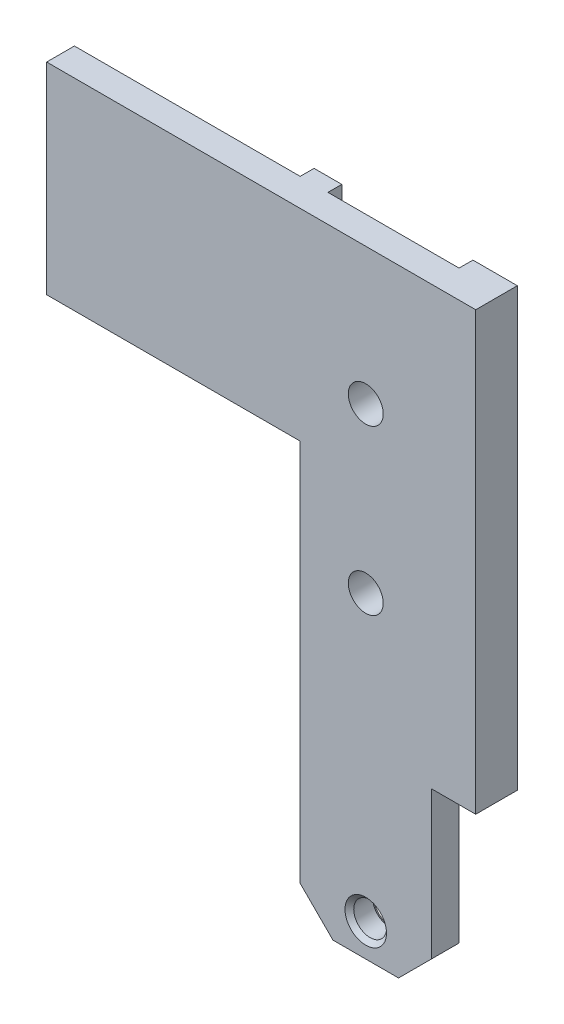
ISO-10303-21;
HEADER;
FILE_DESCRIPTION(('STEP AP214'),'2;1');
FILE_NAME('part.step','',(''),(''),'','','');
FILE_SCHEMA(('AUTOMOTIVE_DESIGN { 1 0 10303 214 1 1 1 1 }'));
ENDSEC;
DATA;
#1=APPLICATION_CONTEXT('core data for automotive mechanical design processes');
#2=APPLICATION_PROTOCOL_DEFINITION('international standard','automotive_design',2000,#1);
#3=PRODUCT_CONTEXT('',#1,'mechanical');
#4=PRODUCT('Part','Part','',(#3));
#5=PRODUCT_RELATED_PRODUCT_CATEGORY('part','',(#4));
#6=PRODUCT_DEFINITION_FORMATION('','',#4);
#7=PRODUCT_DEFINITION_CONTEXT('part definition',#1,'design');
#8=PRODUCT_DEFINITION('design','',#6,#7);
#9=PRODUCT_DEFINITION_SHAPE('','',#8);
#10=(LENGTH_UNIT() NAMED_UNIT(*) SI_UNIT(.MILLI.,.METRE.));
#11=(NAMED_UNIT(*) PLANE_ANGLE_UNIT() SI_UNIT($,.RADIAN.));
#12=(NAMED_UNIT(*) SI_UNIT($,.STERADIAN.) SOLID_ANGLE_UNIT());
#13=UNCERTAINTY_MEASURE_WITH_UNIT(LENGTH_MEASURE(1.E-05),#10,'distance_accuracy_value','');
#14=(GEOMETRIC_REPRESENTATION_CONTEXT(3) GLOBAL_UNCERTAINTY_ASSIGNED_CONTEXT((#13)) GLOBAL_UNIT_ASSIGNED_CONTEXT((#10,
#11,#12)) REPRESENTATION_CONTEXT('',''));
#15=CARTESIAN_POINT('',(0.,0.,0.));
#16=DIRECTION('',(0.,0.,1.));
#17=DIRECTION('',(1.,0.,0.));
#18=AXIS2_PLACEMENT_3D('',#15,#16,#17);
#19=CARTESIAN_POINT('',(-3.00101,0.,-0.634999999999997));
#20=DIRECTION('',(0.,0.,-1.));
#21=DIRECTION('',(-1.,0.,0.));
#22=AXIS2_PLACEMENT_3D('',#19,#20,#21);
#23=PLANE('',#22);
#24=CARTESIAN_POINT('',(0.,-13.75,-0.635));
#25=DIRECTION('',(0.,0.,-1.));
#26=DIRECTION('',(-1.,0.,0.));
#27=AXIS2_PLACEMENT_3D('',#24,#25,#26);
#28=CIRCLE('',#27,0.799999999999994);
#29=CARTESIAN_POINT('',(-0.799999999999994,-13.75,-0.635));
#30=VERTEX_POINT('',#29);
#31=EDGE_CURVE('E335',#30,#30,#28,.T.);
#32=ORIENTED_EDGE('',*,*,#31,.F.);
#33=EDGE_LOOP('',(#32));
#34=FACE_BOUND('',#33,.T.);
#35=CARTESIAN_POINT('',(0.,-6.25,-0.634999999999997));
#36=DIRECTION('',(0.,0.,-1.));
#37=DIRECTION('',(-1.,0.,0.));
#38=AXIS2_PLACEMENT_3D('',#35,#36,#37);
#39=CIRCLE('',#38,0.799999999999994);
#40=CARTESIAN_POINT('',(-0.799999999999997,-6.25,-0.634999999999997));
#41=VERTEX_POINT('',#40);
#42=EDGE_CURVE('E156',#41,#41,#39,.T.);
#43=ORIENTED_EDGE('',*,*,#42,.F.);
#44=EDGE_LOOP('',(#43));
#45=FACE_BOUND('',#44,.T.);
#46=CARTESIAN_POINT('',(0.,-26.755,-0.634999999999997));
#47=DIRECTION('',(0.,0.,-1.));
#48=DIRECTION('',(-1.,0.,0.));
#49=AXIS2_PLACEMENT_3D('',#46,#47,#48);
#50=CIRCLE('',#49,0.950000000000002);
#51=CARTESIAN_POINT('',(-0.950000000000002,-26.755,-0.634999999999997));
#52=VERTEX_POINT('',#51);
#53=EDGE_CURVE('E217',#52,#52,#50,.F.);
#54=ORIENTED_EDGE('',*,*,#53,.T.);
#55=EDGE_LOOP('',(#54));
#56=FACE_BOUND('',#55,.T.);
#57=DIRECTION('',(1.,0.,0.));
#58=VECTOR('',#57,1.);
#59=CARTESIAN_POINT('',(-3.00101,-28.255,-0.635));
#60=LINE('',#59,#58);
#61=CARTESIAN_POINT('',(-1.50101,-28.255,-0.635));
#62=VERTEX_POINT('',#61);
#63=CARTESIAN_POINT('',(1.50101,-28.255,-0.635000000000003));
#64=VERTEX_POINT('',#63);
#65=EDGE_CURVE('E231',#62,#64,#60,.T.);
#66=ORIENTED_EDGE('',*,*,#65,.F.);
#67=DIRECTION('',(0.707106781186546,-0.707106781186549,0.));
#68=VECTOR('',#67,1.);
#69=CARTESIAN_POINT('',(-16.37851,-13.3774999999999,-0.634999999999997));
#70=LINE('',#69,#68);
#71=CARTESIAN_POINT('',(-3.00101,-26.755,-0.634999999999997));
#72=VERTEX_POINT('',#71);
#73=EDGE_CURVE('E205',#62,#72,#70,.F.);
#74=ORIENTED_EDGE('',*,*,#73,.T.);
#75=DIRECTION('',(0.,-1.,0.));
#76=VECTOR('',#75,1.);
#77=CARTESIAN_POINT('',(-3.00101,-9.2253064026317,-0.635));
#78=LINE('',#77,#76);
#79=CARTESIAN_POINT('',(-3.00101,-9.2253064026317,-0.635));
#80=VERTEX_POINT('',#79);
#81=EDGE_CURVE('E235',#80,#72,#78,.T.);
#82=ORIENTED_EDGE('',*,*,#81,.F.);
#83=DIRECTION('',(0.,-1.,0.));
#84=VECTOR('',#83,1.);
#85=CARTESIAN_POINT('',(-3.00101,-9.2253064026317,-0.635));
#86=LINE('',#85,#84);
#87=CARTESIAN_POINT('',(-3.00101,0.,-0.634999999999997));
#88=VERTEX_POINT('',#87);
#89=EDGE_CURVE('E252',#88,#80,#86,.T.);
#90=ORIENTED_EDGE('',*,*,#89,.F.);
#91=DIRECTION('',(-1.,0.,0.));
#92=VECTOR('',#91,1.);
#93=CARTESIAN_POINT('',(5.03301,0.,-0.635));
#94=LINE('',#93,#92);
#95=CARTESIAN_POINT('',(3.00101,0.,-0.635));
#96=VERTEX_POINT('',#95);
#97=EDGE_CURVE('E225',#96,#88,#94,.T.);
#98=ORIENTED_EDGE('',*,*,#97,.F.);
#99=DIRECTION('',(0.,1.,0.));
#100=VECTOR('',#99,1.);
#101=CARTESIAN_POINT('',(3.00101,0.,-0.635));
#102=LINE('',#101,#100);
#103=CARTESIAN_POINT('',(3.00101,-20.,-0.635000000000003));
#104=VERTEX_POINT('',#103);
#105=EDGE_CURVE('E310',#104,#96,#102,.T.);
#106=ORIENTED_EDGE('',*,*,#105,.F.);
#107=CARTESIAN_POINT('',(3.00101,-26.755,-0.635));
#108=VERTEX_POINT('',#107);
#109=EDGE_CURVE('E308',#108,#104,#102,.T.);
#110=ORIENTED_EDGE('',*,*,#109,.F.);
#111=DIRECTION('',(0.707106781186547,0.707106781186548,0.));
#112=VECTOR('',#111,1.);
#113=CARTESIAN_POINT('',(13.3775,-16.37851,-0.635));
#114=LINE('',#113,#112);
#115=EDGE_CURVE('E207',#108,#64,#114,.F.);
#116=ORIENTED_EDGE('',*,*,#115,.T.);
#117=EDGE_LOOP('',(#66,#74,#82,#90,#98,#106,#110,#116));
#118=FACE_BOUND('',#117,.T.);
#119=ADVANCED_FACE('F30',(#34,#45,#56,#118),#23,.T.);
#120=DIRECTION('',(0.,1.,0.));
#121=VECTOR('',#120,1.);
#122=CARTESIAN_POINT('',(-4.27101,-9.22530640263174,-0.635));
#123=LINE('',#122,#121);
#124=CARTESIAN_POINT('',(-4.27101,-9.22530640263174,-0.635));
#125=VERTEX_POINT('',#124);
#126=CARTESIAN_POINT('',(-4.27101,0.,-0.634999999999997));
#127=VERTEX_POINT('',#126);
#128=EDGE_CURVE('E258',#125,#127,#123,.T.);
#129=ORIENTED_EDGE('',*,*,#128,.F.);
#130=DIRECTION('',(1.,0.,0.));
#131=VECTOR('',#130,1.);
#132=CARTESIAN_POINT('',(-14.605,-9.2253064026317,-0.635000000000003));
#133=LINE('',#132,#131);
#134=CARTESIAN_POINT('',(-14.605,-9.2253064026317,-0.635000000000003));
#135=VERTEX_POINT('',#134);
#136=EDGE_CURVE('E183',#135,#125,#133,.T.);
#137=ORIENTED_EDGE('',*,*,#136,.F.);
#138=DIRECTION('',(0.,-1.,0.));
#139=VECTOR('',#138,1.);
#140=CARTESIAN_POINT('',(-14.605,0.,-0.635));
#141=LINE('',#140,#139);
#142=CARTESIAN_POINT('',(-14.605,0.,-0.635));
#143=VERTEX_POINT('',#142);
#144=EDGE_CURVE('E187',#143,#135,#141,.T.);
#145=ORIENTED_EDGE('',*,*,#144,.F.);
#146=EDGE_CURVE('E188',#127,#143,#94,.T.);
#147=ORIENTED_EDGE('',*,*,#146,.F.);
#148=EDGE_LOOP('',(#129,#137,#145,#147));
#149=FACE_BOUND('',#148,.T.);
#150=ADVANCED_FACE('F277',(#149),#23,.T.);
#151=CARTESIAN_POINT('',(-3.00101,-9.2253064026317,0.635));
#152=DIRECTION('',(1.,0.,0.));
#153=DIRECTION('',(0.,1.,0.));
#154=AXIS2_PLACEMENT_3D('',#151,#152,#153);
#155=PLANE('',#154);
#156=ORIENTED_EDGE('',*,*,#81,.T.);
#157=DIRECTION('',(0.,0.,1.));
#158=VECTOR('',#157,1.);
#159=CARTESIAN_POINT('',(-3.00101,-26.755,0.635000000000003));
#160=LINE('',#159,#158);
#161=CARTESIAN_POINT('',(-3.00101,-26.755,0.635000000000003));
#162=VERTEX_POINT('',#161);
#163=EDGE_CURVE('E53',#72,#162,#160,.T.);
#164=ORIENTED_EDGE('',*,*,#163,.T.);
#165=DIRECTION('',(0.,-1.,0.));
#166=VECTOR('',#165,1.);
#167=CARTESIAN_POINT('',(-3.00101,-9.2253064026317,0.635));
#168=LINE('',#167,#166);
#169=CARTESIAN_POINT('',(-3.00101,-9.2253064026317,0.635));
#170=VERTEX_POINT('',#169);
#171=EDGE_CURVE('E166',#170,#162,#168,.T.);
#172=ORIENTED_EDGE('',*,*,#171,.F.);
#173=DIRECTION('',(0.,0.,-1.));
#174=VECTOR('',#173,1.);
#175=CARTESIAN_POINT('',(-3.00101,-9.2253064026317,0.635));
#176=LINE('',#175,#174);
#177=EDGE_CURVE('E173',#170,#80,#176,.T.);
#178=ORIENTED_EDGE('',*,*,#177,.T.);
#179=EDGE_LOOP('',(#156,#164,#172,#178));
#180=FACE_BOUND('',#179,.T.);
#181=ADVANCED_FACE('F32',(#180),#155,.F.);
#182=CARTESIAN_POINT('',(-3.00101,-28.255,0.635));
#183=DIRECTION('',(0.,1.,0.));
#184=DIRECTION('',(0.,0.,1.));
#185=AXIS2_PLACEMENT_3D('',#182,#183,#184);
#186=PLANE('',#185);
#187=DIRECTION('',(1.,0.,0.));
#188=VECTOR('',#187,1.);
#189=CARTESIAN_POINT('',(-3.00101,-28.255,0.635));
#190=LINE('',#189,#188);
#191=CARTESIAN_POINT('',(-1.50101,-28.255,0.635));
#192=VERTEX_POINT('',#191);
#193=CARTESIAN_POINT('',(1.50101,-28.255,0.634999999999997));
#194=VERTEX_POINT('',#193);
#195=EDGE_CURVE('E162',#192,#194,#190,.T.);
#196=ORIENTED_EDGE('',*,*,#195,.F.);
#197=DIRECTION('',(0.,0.,-1.));
#198=VECTOR('',#197,1.);
#199=CARTESIAN_POINT('',(-1.50101,-28.255,0.635));
#200=LINE('',#199,#198);
#201=EDGE_CURVE('E201',#192,#62,#200,.T.);
#202=ORIENTED_EDGE('',*,*,#201,.T.);
#203=ORIENTED_EDGE('',*,*,#65,.T.);
#204=DIRECTION('',(0.,0.,1.));
#205=VECTOR('',#204,1.);
#206=CARTESIAN_POINT('',(1.50101,-28.255,0.634999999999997));
#207=LINE('',#206,#205);
#208=EDGE_CURVE('E210',#64,#194,#207,.T.);
#209=ORIENTED_EDGE('',*,*,#208,.T.);
#210=EDGE_LOOP('',(#196,#202,#203,#209));
#211=FACE_BOUND('',#210,.T.);
#212=ADVANCED_FACE('F299',(#211),#186,.F.);
#213=CARTESIAN_POINT('',(5.03301,0.,0.635));
#214=DIRECTION('',(-1.,0.,0.));
#215=DIRECTION('',(0.,-1.,0.));
#216=AXIS2_PLACEMENT_3D('',#213,#214,#215);
#217=PLANE('',#216);
#218=DIRECTION('',(0.,1.,0.));
#219=VECTOR('',#218,1.);
#220=CARTESIAN_POINT('',(5.03301,0.,0.635));
#221=LINE('',#220,#219);
#222=CARTESIAN_POINT('',(5.03301,-20.,0.634999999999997));
#223=VERTEX_POINT('',#222);
#224=CARTESIAN_POINT('',(5.03301,0.,0.635));
#225=VERTEX_POINT('',#224);
#226=EDGE_CURVE('E154',#223,#225,#221,.T.);
#227=ORIENTED_EDGE('',*,*,#226,.F.);
#228=DIRECTION('',(0.,0.,1.));
#229=VECTOR('',#228,1.);
#230=CARTESIAN_POINT('',(5.03301,-20.,-1.270025));
#231=LINE('',#230,#229);
#232=CARTESIAN_POINT('',(5.03301,-20.,-1.27));
#233=VERTEX_POINT('',#232);
#234=EDGE_CURVE('E139',#233,#223,#231,.T.);
#235=ORIENTED_EDGE('',*,*,#234,.F.);
#236=DIRECTION('',(0.,-1.,0.));
#237=VECTOR('',#236,1.);
#238=CARTESIAN_POINT('',(5.03301,0.,-1.27));
#239=LINE('',#238,#237);
#240=CARTESIAN_POINT('',(5.03301,0.,-1.27));
#241=VERTEX_POINT('',#240);
#242=EDGE_CURVE('E311',#241,#233,#239,.T.);
#243=ORIENTED_EDGE('',*,*,#242,.F.);
#244=DIRECTION('',(0.,0.,-1.));
#245=VECTOR('',#244,1.);
#246=CARTESIAN_POINT('',(5.03301,0.,0.635));
#247=LINE('',#246,#245);
#248=EDGE_CURVE('E159',#225,#241,#247,.T.);
#249=ORIENTED_EDGE('',*,*,#248,.F.);
#250=EDGE_LOOP('',(#227,#235,#243,#249));
#251=FACE_BOUND('',#250,.T.);
#252=ADVANCED_FACE('F158',(#251),#217,.F.);
#253=CARTESIAN_POINT('',(5.03301,0.,0.635));
#254=DIRECTION('',(0.,-1.,0.));
#255=DIRECTION('',(1.,0.,0.));
#256=AXIS2_PLACEMENT_3D('',#253,#254,#255);
#257=PLANE('',#256);
#258=ORIENTED_EDGE('',*,*,#248,.T.);
#259=DIRECTION('',(1.,0.,0.));
#260=VECTOR('',#259,1.);
#261=CARTESIAN_POINT('',(5.03301,0.,-1.27));
#262=LINE('',#261,#260);
#263=CARTESIAN_POINT('',(3.00101,0.,-1.27));
#264=VERTEX_POINT('',#263);
#265=EDGE_CURVE('E318',#264,#241,#262,.T.);
#266=ORIENTED_EDGE('',*,*,#265,.F.);
#267=DIRECTION('',(0.,0.,1.));
#268=VECTOR('',#267,1.);
#269=CARTESIAN_POINT('',(3.00101,0.,-1.27));
#270=LINE('',#269,#268);
#271=EDGE_CURVE('E255',#264,#96,#270,.T.);
#272=ORIENTED_EDGE('',*,*,#271,.T.);
#273=ORIENTED_EDGE('',*,*,#97,.T.);
#274=DIRECTION('',(0.,0.,1.));
#275=VECTOR('',#274,1.);
#276=CARTESIAN_POINT('',(-3.00101,0.,-1.27));
#277=LINE('',#276,#275);
#278=CARTESIAN_POINT('',(-3.00101,0.,-1.27));
#279=VERTEX_POINT('',#278);
#280=EDGE_CURVE('E241',#279,#88,#277,.T.);
#281=ORIENTED_EDGE('',*,*,#280,.F.);
#282=DIRECTION('',(1.,0.,0.));
#283=VECTOR('',#282,1.);
#284=CARTESIAN_POINT('',(-4.27101,0.,-1.27));
#285=LINE('',#284,#283);
#286=CARTESIAN_POINT('',(-4.27101,0.,-1.27));
#287=VERTEX_POINT('',#286);
#288=EDGE_CURVE('E247',#287,#279,#285,.T.);
#289=ORIENTED_EDGE('',*,*,#288,.F.);
#290=DIRECTION('',(0.,0.,1.));
#291=VECTOR('',#290,1.);
#292=CARTESIAN_POINT('',(-4.27101,0.,-1.27));
#293=LINE('',#292,#291);
#294=EDGE_CURVE('E237',#287,#127,#293,.T.);
#295=ORIENTED_EDGE('',*,*,#294,.T.);
#296=ORIENTED_EDGE('',*,*,#146,.T.);
#297=DIRECTION('',(0.,0.,-1.));
#298=VECTOR('',#297,1.);
#299=CARTESIAN_POINT('',(-14.605,0.,0.635));
#300=LINE('',#299,#298);
#301=CARTESIAN_POINT('',(-14.605,0.,0.635));
#302=VERTEX_POINT('',#301);
#303=EDGE_CURVE('E178',#302,#143,#300,.T.);
#304=ORIENTED_EDGE('',*,*,#303,.F.);
#305=DIRECTION('',(-1.,0.,0.));
#306=VECTOR('',#305,1.);
#307=CARTESIAN_POINT('',(5.03301,0.,0.635));
#308=LINE('',#307,#306);
#309=EDGE_CURVE('E161',#225,#302,#308,.T.);
#310=ORIENTED_EDGE('',*,*,#309,.F.);
#311=EDGE_LOOP('',(#258,#266,#272,#273,#281,#289,#295,#296,#304,#310));
#312=FACE_BOUND('',#311,.T.);
#313=ADVANCED_FACE('F281',(#312),#257,.F.);
#314=CARTESIAN_POINT('',(-14.605,0.,0.635));
#315=DIRECTION('',(1.,0.,0.));
#316=DIRECTION('',(0.,1.,0.));
#317=AXIS2_PLACEMENT_3D('',#314,#315,#316);
#318=PLANE('',#317);
#319=ORIENTED_EDGE('',*,*,#303,.T.);
#320=ORIENTED_EDGE('',*,*,#144,.T.);
#321=DIRECTION('',(0.,0.,-1.));
#322=VECTOR('',#321,1.);
#323=CARTESIAN_POINT('',(-14.605,-9.2253064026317,0.634999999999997));
#324=LINE('',#323,#322);
#325=CARTESIAN_POINT('',(-14.605,-9.2253064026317,0.634999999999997));
#326=VERTEX_POINT('',#325);
#327=EDGE_CURVE('E176',#326,#135,#324,.T.);
#328=ORIENTED_EDGE('',*,*,#327,.F.);
#329=DIRECTION('',(0.,-1.,0.));
#330=VECTOR('',#329,1.);
#331=CARTESIAN_POINT('',(-14.605,0.,0.635));
#332=LINE('',#331,#330);
#333=EDGE_CURVE('E164',#302,#326,#332,.T.);
#334=ORIENTED_EDGE('',*,*,#333,.F.);
#335=EDGE_LOOP('',(#319,#320,#328,#334));
#336=FACE_BOUND('',#335,.T.);
#337=ADVANCED_FACE('F383',(#336),#318,.F.);
#338=CARTESIAN_POINT('',(-14.605,-9.2253064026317,0.634999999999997));
#339=DIRECTION('',(0.,1.,0.));
#340=DIRECTION('',(0.,0.,1.));
#341=AXIS2_PLACEMENT_3D('',#338,#339,#340);
#342=PLANE('',#341);
#343=ORIENTED_EDGE('',*,*,#327,.T.);
#344=ORIENTED_EDGE('',*,*,#136,.T.);
#345=DIRECTION('',(0.,0.,1.));
#346=VECTOR('',#345,1.);
#347=CARTESIAN_POINT('',(-4.27101,-9.22530640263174,-1.27));
#348=LINE('',#347,#346);
#349=CARTESIAN_POINT('',(-4.27101,-9.22530640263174,-1.27));
#350=VERTEX_POINT('',#349);
#351=EDGE_CURVE('E242',#350,#125,#348,.T.);
#352=ORIENTED_EDGE('',*,*,#351,.F.);
#353=DIRECTION('',(-1.,0.,0.));
#354=VECTOR('',#353,1.);
#355=CARTESIAN_POINT('',(-4.27101,-9.22530640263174,-1.27));
#356=LINE('',#355,#354);
#357=CARTESIAN_POINT('',(-3.00101,-9.2253064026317,-1.27));
#358=VERTEX_POINT('',#357);
#359=EDGE_CURVE('E243',#358,#350,#356,.T.);
#360=ORIENTED_EDGE('',*,*,#359,.F.);
#361=DIRECTION('',(0.,0.,1.));
#362=VECTOR('',#361,1.);
#363=CARTESIAN_POINT('',(-3.00101,-9.2253064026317,-1.27));
#364=LINE('',#363,#362);
#365=EDGE_CURVE('E238',#358,#80,#364,.T.);
#366=ORIENTED_EDGE('',*,*,#365,.T.);
#367=ORIENTED_EDGE('',*,*,#177,.F.);
#368=DIRECTION('',(1.,0.,0.));
#369=VECTOR('',#368,1.);
#370=CARTESIAN_POINT('',(-14.605,-9.2253064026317,0.634999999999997));
#371=LINE('',#370,#369);
#372=EDGE_CURVE('E171',#326,#170,#371,.T.);
#373=ORIENTED_EDGE('',*,*,#372,.F.);
#374=EDGE_LOOP('',(#343,#344,#352,#360,#366,#367,#373));
#375=FACE_BOUND('',#374,.T.);
#376=ADVANCED_FACE('F271',(#375),#342,.F.);
#377=CARTESIAN_POINT('',(-3.00101,0.,0.635000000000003));
#378=DIRECTION('',(0.,0.,-1.));
#379=DIRECTION('',(-1.,0.,0.));
#380=AXIS2_PLACEMENT_3D('',#377,#378,#379);
#381=PLANE('',#380);
#382=CARTESIAN_POINT('',(0.,-13.75,0.635000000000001));
#383=DIRECTION('',(0.,0.,1.));
#384=DIRECTION('',(1.,0.,0.));
#385=AXIS2_PLACEMENT_3D('',#382,#383,#384);
#386=CIRCLE('',#385,0.799999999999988);
#387=CARTESIAN_POINT('',(0.799999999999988,-13.75,0.635000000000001));
#388=VERTEX_POINT('',#387);
#389=EDGE_CURVE('E338',#388,#388,#386,.T.);
#390=ORIENTED_EDGE('',*,*,#389,.F.);
#391=EDGE_LOOP('',(#390));
#392=FACE_BOUND('',#391,.T.);
#393=CARTESIAN_POINT('',(0.,-6.25,0.635000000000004));
#394=DIRECTION('',(0.,0.,1.));
#395=DIRECTION('',(1.,0.,0.));
#396=AXIS2_PLACEMENT_3D('',#393,#394,#395);
#397=CIRCLE('',#396,0.799999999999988);
#398=CARTESIAN_POINT('',(0.799999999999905,-6.25,0.635000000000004));
#399=VERTEX_POINT('',#398);
#400=EDGE_CURVE('E332',#399,#399,#397,.T.);
#401=ORIENTED_EDGE('',*,*,#400,.F.);
#402=EDGE_LOOP('',(#401));
#403=FACE_BOUND('',#402,.T.);
#404=CARTESIAN_POINT('',(0.,-26.755,0.635000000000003));
#405=DIRECTION('',(0.,0.,-1.));
#406=DIRECTION('',(-1.,0.,0.));
#407=AXIS2_PLACEMENT_3D('',#404,#405,#406);
#408=CIRCLE('',#407,0.950000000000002);
#409=CARTESIAN_POINT('',(-0.950000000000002,-26.755,0.635000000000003));
#410=VERTEX_POINT('',#409);
#411=EDGE_CURVE('E214',#410,#410,#408,.T.);
#412=ORIENTED_EDGE('',*,*,#411,.T.);
#413=EDGE_LOOP('',(#412));
#414=FACE_BOUND('',#413,.T.);
#415=ORIENTED_EDGE('',*,*,#171,.T.);
#416=DIRECTION('',(-0.707106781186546,0.707106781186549,0.));
#417=VECTOR('',#416,1.);
#418=CARTESIAN_POINT('',(-1.50101,-28.255,0.635));
#419=LINE('',#418,#417);
#420=EDGE_CURVE('E38',#162,#192,#419,.F.);
#421=ORIENTED_EDGE('',*,*,#420,.T.);
#422=ORIENTED_EDGE('',*,*,#195,.T.);
#423=DIRECTION('',(-0.707106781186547,-0.707106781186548,0.));
#424=VECTOR('',#423,1.);
#425=CARTESIAN_POINT('',(1.50101,-28.255,0.634999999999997));
#426=LINE('',#425,#424);
#427=CARTESIAN_POINT('',(3.00101,-26.755,0.635));
#428=VERTEX_POINT('',#427);
#429=EDGE_CURVE('E45',#194,#428,#426,.F.);
#430=ORIENTED_EDGE('',*,*,#429,.T.);
#431=DIRECTION('',(0.,-1.,0.));
#432=VECTOR('',#431,1.);
#433=CARTESIAN_POINT('',(3.00101,-28.255,0.635));
#434=LINE('',#433,#432);
#435=CARTESIAN_POINT('',(3.00101,-20.,0.634999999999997));
#436=VERTEX_POINT('',#435);
#437=EDGE_CURVE('E151',#436,#428,#434,.T.);
#438=ORIENTED_EDGE('',*,*,#437,.F.);
#439=DIRECTION('',(-1.,0.,0.));
#440=VECTOR('',#439,1.);
#441=CARTESIAN_POINT('',(5.03301,-20.,0.634999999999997));
#442=LINE('',#441,#440);
#443=EDGE_CURVE('E143',#223,#436,#442,.T.);
#444=ORIENTED_EDGE('',*,*,#443,.F.);
#445=ORIENTED_EDGE('',*,*,#226,.T.);
#446=ORIENTED_EDGE('',*,*,#309,.T.);
#447=ORIENTED_EDGE('',*,*,#333,.T.);
#448=ORIENTED_EDGE('',*,*,#372,.T.);
#449=EDGE_LOOP('',(#415,#421,#422,#430,#438,#444,#445,#446,#447,#448));
#450=FACE_BOUND('',#449,.T.);
#451=ADVANCED_FACE('F153',(#392,#403,#414,#450),#381,.F.);
#452=CARTESIAN_POINT('',(-4.27101,-9.22530640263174,-1.27));
#453=DIRECTION('',(1.,0.,0.));
#454=DIRECTION('',(0.,0.,-1.));
#455=AXIS2_PLACEMENT_3D('',#452,#453,#454);
#456=PLANE('',#455);
#457=ORIENTED_EDGE('',*,*,#128,.T.);
#458=ORIENTED_EDGE('',*,*,#294,.F.);
#459=DIRECTION('',(0.,1.,0.));
#460=VECTOR('',#459,1.);
#461=CARTESIAN_POINT('',(-4.27101,-9.22530640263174,-1.27));
#462=LINE('',#461,#460);
#463=EDGE_CURVE('E249',#350,#287,#462,.T.);
#464=ORIENTED_EDGE('',*,*,#463,.F.);
#465=ORIENTED_EDGE('',*,*,#351,.T.);
#466=EDGE_LOOP('',(#457,#458,#464,#465));
#467=FACE_BOUND('',#466,.T.);
#468=ADVANCED_FACE('F267',(#467),#456,.F.);
#469=CARTESIAN_POINT('',(-3.00101,-9.2253064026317,-1.27));
#470=DIRECTION('',(-1.,0.,0.));
#471=DIRECTION('',(0.,-1.,0.));
#472=AXIS2_PLACEMENT_3D('',#469,#470,#471);
#473=PLANE('',#472);
#474=ORIENTED_EDGE('',*,*,#89,.T.);
#475=ORIENTED_EDGE('',*,*,#365,.F.);
#476=DIRECTION('',(0.,-1.,0.));
#477=VECTOR('',#476,1.);
#478=CARTESIAN_POINT('',(-3.00101,-9.2253064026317,-1.27));
#479=LINE('',#478,#477);
#480=EDGE_CURVE('E245',#279,#358,#479,.T.);
#481=ORIENTED_EDGE('',*,*,#480,.F.);
#482=ORIENTED_EDGE('',*,*,#280,.T.);
#483=EDGE_LOOP('',(#474,#475,#481,#482));
#484=FACE_BOUND('',#483,.T.);
#485=ADVANCED_FACE('F293',(#484),#473,.F.);
#486=CARTESIAN_POINT('',(-4.27101,-9.22530640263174,-1.27));
#487=DIRECTION('',(0.,0.,-1.));
#488=DIRECTION('',(-1.,0.,0.));
#489=AXIS2_PLACEMENT_3D('',#486,#487,#488);
#490=PLANE('',#489);
#491=ORIENTED_EDGE('',*,*,#463,.T.);
#492=ORIENTED_EDGE('',*,*,#288,.T.);
#493=ORIENTED_EDGE('',*,*,#480,.T.);
#494=ORIENTED_EDGE('',*,*,#359,.T.);
#495=EDGE_LOOP('',(#491,#492,#493,#494));
#496=FACE_BOUND('',#495,.T.);
#497=ADVANCED_FACE('F458',(#496),#490,.T.);
#498=CARTESIAN_POINT('',(3.00101,0.,-1.27));
#499=DIRECTION('',(1.,0.,0.));
#500=DIRECTION('',(0.,1.,0.));
#501=AXIS2_PLACEMENT_3D('',#498,#499,#500);
#502=PLANE('',#501);
#503=DIRECTION('',(0.,1.,0.));
#504=VECTOR('',#503,1.);
#505=CARTESIAN_POINT('',(3.00101,0.,-1.27));
#506=LINE('',#505,#504);
#507=CARTESIAN_POINT('',(3.00101,-20.,-1.27));
#508=VERTEX_POINT('',#507);
#509=EDGE_CURVE('E313',#508,#264,#506,.T.);
#510=ORIENTED_EDGE('',*,*,#509,.F.);
#511=DIRECTION('',(0.,0.,1.));
#512=VECTOR('',#511,1.);
#513=CARTESIAN_POINT('',(3.00101,-20.,-1.270025));
#514=LINE('',#513,#512);
#515=EDGE_CURVE('E315',#508,#104,#514,.T.);
#516=ORIENTED_EDGE('',*,*,#515,.T.);
#517=ORIENTED_EDGE('',*,*,#105,.T.);
#518=ORIENTED_EDGE('',*,*,#271,.F.);
#519=EDGE_LOOP('',(#510,#516,#517,#518));
#520=FACE_BOUND('',#519,.T.);
#521=ADVANCED_FACE('F326',(#520),#502,.F.);
#522=CARTESIAN_POINT('',(5.03301,-28.255,-1.27));
#523=DIRECTION('',(0.,0.,-1.));
#524=DIRECTION('',(-1.,0.,0.));
#525=AXIS2_PLACEMENT_3D('',#522,#523,#524);
#526=PLANE('',#525);
#527=DIRECTION('',(1.,0.,0.));
#528=VECTOR('',#527,1.);
#529=CARTESIAN_POINT('',(5.03301,-20.,-1.27));
#530=LINE('',#529,#528);
#531=EDGE_CURVE('E145',#508,#233,#530,.T.);
#532=ORIENTED_EDGE('',*,*,#531,.F.);
#533=ORIENTED_EDGE('',*,*,#509,.T.);
#534=ORIENTED_EDGE('',*,*,#265,.T.);
#535=ORIENTED_EDGE('',*,*,#242,.T.);
#536=EDGE_LOOP('',(#532,#533,#534,#535));
#537=FACE_BOUND('',#536,.T.);
#538=ADVANCED_FACE('F360',(#537),#526,.T.);
#539=CARTESIAN_POINT('',(0.,-26.755,-1.270025));
#540=DIRECTION('',(0.,0.,1.));
#541=DIRECTION('',(1.,0.,0.));
#542=AXIS2_PLACEMENT_3D('',#539,#540,#541);
#543=CYLINDRICAL_SURFACE('',#542,0.750000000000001);
#544=CARTESIAN_POINT('',(0.,-26.755,-0.435));
#545=DIRECTION('',(0.,0.,-1.));
#546=DIRECTION('',(-1.,0.,0.));
#547=AXIS2_PLACEMENT_3D('',#544,#545,#546);
#548=CIRCLE('',#547,0.750000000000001);
#549=CARTESIAN_POINT('',(-0.750000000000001,-26.755,-0.435));
#550=VERTEX_POINT('',#549);
#551=EDGE_CURVE('E220',#550,#550,#548,.T.);
#552=ORIENTED_EDGE('',*,*,#551,.T.);
#553=EDGE_LOOP('',(#552));
#554=FACE_BOUND('',#553,.T.);
#555=CARTESIAN_POINT('',(0.,-26.755,0.435));
#556=DIRECTION('',(0.,0.,-1.));
#557=DIRECTION('',(-1.,0.,0.));
#558=AXIS2_PLACEMENT_3D('',#555,#556,#557);
#559=CIRCLE('',#558,0.750000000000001);
#560=CARTESIAN_POINT('',(-0.750000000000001,-26.755,0.435));
#561=VERTEX_POINT('',#560);
#562=EDGE_CURVE('E182',#561,#561,#559,.F.);
#563=ORIENTED_EDGE('',*,*,#562,.T.);
#564=EDGE_LOOP('',(#563));
#565=FACE_BOUND('',#564,.T.);
#566=ADVANCED_FACE('F358',(#554,#565),#543,.F.);
#567=CARTESIAN_POINT('',(0.,-26.755,-0.435));
#568=DIRECTION('',(0.,0.,-1.));
#569=DIRECTION('',(-1.,0.,0.));
#570=AXIS2_PLACEMENT_3D('',#567,#568,#569);
#571=CONICAL_SURFACE('',#570,0.750000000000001,0.78539816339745);
#572=ORIENTED_EDGE('',*,*,#53,.F.);
#573=EDGE_LOOP('',(#572));
#574=FACE_BOUND('',#573,.T.);
#575=ORIENTED_EDGE('',*,*,#551,.F.);
#576=EDGE_LOOP('',(#575));
#577=FACE_BOUND('',#576,.T.);
#578=ADVANCED_FACE('F354',(#574,#577),#571,.F.);
#579=CARTESIAN_POINT('',(0.,-26.755,0.435));
#580=DIRECTION('',(0.,0.,1.));
#581=DIRECTION('',(1.,0.,0.));
#582=AXIS2_PLACEMENT_3D('',#579,#580,#581);
#583=CONICAL_SURFACE('',#582,0.750000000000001,0.785398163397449);
#584=ORIENTED_EDGE('',*,*,#411,.F.);
#585=EDGE_LOOP('',(#584));
#586=FACE_BOUND('',#585,.T.);
#587=ORIENTED_EDGE('',*,*,#562,.F.);
#588=EDGE_LOOP('',(#587));
#589=FACE_BOUND('',#588,.T.);
#590=ADVANCED_FACE('F351',(#586,#589),#583,.F.);
#591=CARTESIAN_POINT('',(3.00100999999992,-28.255,-1.270025));
#592=DIRECTION('',(-1.,0.,0.));
#593=DIRECTION('',(0.,-1.,0.));
#594=AXIS2_PLACEMENT_3D('',#591,#592,#593);
#595=PLANE('',#594);
#596=ORIENTED_EDGE('',*,*,#437,.T.);
#597=DIRECTION('',(0.,0.,-1.));
#598=VECTOR('',#597,1.);
#599=CARTESIAN_POINT('',(3.00101,-26.755,-1.270025));
#600=LINE('',#599,#598);
#601=EDGE_CURVE('E11',#428,#108,#600,.T.);
#602=ORIENTED_EDGE('',*,*,#601,.T.);
#603=ORIENTED_EDGE('',*,*,#109,.T.);
#604=EDGE_CURVE('E150',#104,#436,#514,.T.);
#605=ORIENTED_EDGE('',*,*,#604,.T.);
#606=EDGE_LOOP('',(#596,#602,#603,#605));
#607=FACE_BOUND('',#606,.T.);
#608=ADVANCED_FACE('F307',(#607),#595,.F.);
#609=CARTESIAN_POINT('',(5.03301,-20.,-1.270025));
#610=DIRECTION('',(0.,1.,0.));
#611=DIRECTION('',(0.,0.,1.));
#612=AXIS2_PLACEMENT_3D('',#609,#610,#611);
#613=PLANE('',#612);
#614=ORIENTED_EDGE('',*,*,#531,.T.);
#615=ORIENTED_EDGE('',*,*,#234,.T.);
#616=ORIENTED_EDGE('',*,*,#443,.T.);
#617=ORIENTED_EDGE('',*,*,#604,.F.);
#618=ORIENTED_EDGE('',*,*,#515,.F.);
#619=EDGE_LOOP('',(#614,#615,#616,#617,#618));
#620=FACE_BOUND('',#619,.T.);
#621=ADVANCED_FACE('F141',(#620),#613,.F.);
#622=CARTESIAN_POINT('',(-1.50101,-28.255,0.635));
#623=DIRECTION('',(0.707106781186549,0.707106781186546,0.));
#624=DIRECTION('',(-0.707106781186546,0.707106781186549,0.));
#625=AXIS2_PLACEMENT_3D('',#622,#623,#624);
#626=PLANE('',#625);
#627=ORIENTED_EDGE('',*,*,#420,.F.);
#628=ORIENTED_EDGE('',*,*,#163,.F.);
#629=ORIENTED_EDGE('',*,*,#73,.F.);
#630=ORIENTED_EDGE('',*,*,#201,.F.);
#631=EDGE_LOOP('',(#627,#628,#629,#630));
#632=FACE_BOUND('',#631,.T.);
#633=ADVANCED_FACE('F199',(#632),#626,.F.);
#634=CARTESIAN_POINT('',(1.50101,-28.255,0.634999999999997));
#635=DIRECTION('',(-0.707106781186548,0.707106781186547,0.));
#636=DIRECTION('',(-0.707106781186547,-0.707106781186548,0.));
#637=AXIS2_PLACEMENT_3D('',#634,#635,#636);
#638=PLANE('',#637);
#639=ORIENTED_EDGE('',*,*,#115,.F.);
#640=ORIENTED_EDGE('',*,*,#601,.F.);
#641=ORIENTED_EDGE('',*,*,#429,.F.);
#642=ORIENTED_EDGE('',*,*,#208,.F.);
#643=EDGE_LOOP('',(#639,#640,#641,#642));
#644=FACE_BOUND('',#643,.T.);
#645=ADVANCED_FACE('F303',(#644),#638,.F.);
#646=CARTESIAN_POINT('',(0.,-6.25,0.635000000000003));
#647=DIRECTION('',(0.,0.,1.));
#648=DIRECTION('',(1.,0.,0.));
#649=AXIS2_PLACEMENT_3D('',#646,#647,#648);
#650=CYLINDRICAL_SURFACE('',#649,0.799999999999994);
#651=ORIENTED_EDGE('',*,*,#42,.T.);
#652=EDGE_LOOP('',(#651));
#653=FACE_BOUND('',#652,.T.);
#654=ORIENTED_EDGE('',*,*,#400,.T.);
#655=EDGE_LOOP('',(#654));
#656=FACE_BOUND('',#655,.T.);
#657=ADVANCED_FACE('F520',(#653,#656),#650,.F.);
#658=CARTESIAN_POINT('',(0.,-13.75,0.635));
#659=DIRECTION('',(0.,0.,1.));
#660=DIRECTION('',(1.,0.,0.));
#661=AXIS2_PLACEMENT_3D('',#658,#659,#660);
#662=CYLINDRICAL_SURFACE('',#661,0.799999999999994);
#663=ORIENTED_EDGE('',*,*,#31,.T.);
#664=EDGE_LOOP('',(#663));
#665=FACE_BOUND('',#664,.T.);
#666=ORIENTED_EDGE('',*,*,#389,.T.);
#667=EDGE_LOOP('',(#666));
#668=FACE_BOUND('',#667,.T.);
#669=ADVANCED_FACE('F342',(#665,#668),#662,.F.);
#670=CLOSED_SHELL('',(#119,#150,#181,#212,#252,#313,#337,#376,#451,#468,#485,#497,#521,#538,
#566,#578,#590,#608,#621,#633,#645,#657,#669));
#671=MANIFOLD_SOLID_BREP('B2',#670);
#672=ADVANCED_BREP_SHAPE_REPRESENTATION('',(#18,#671),#14);
#673=SHAPE_DEFINITION_REPRESENTATION(#9,#672);
ENDSEC;
END-ISO-10303-21;
